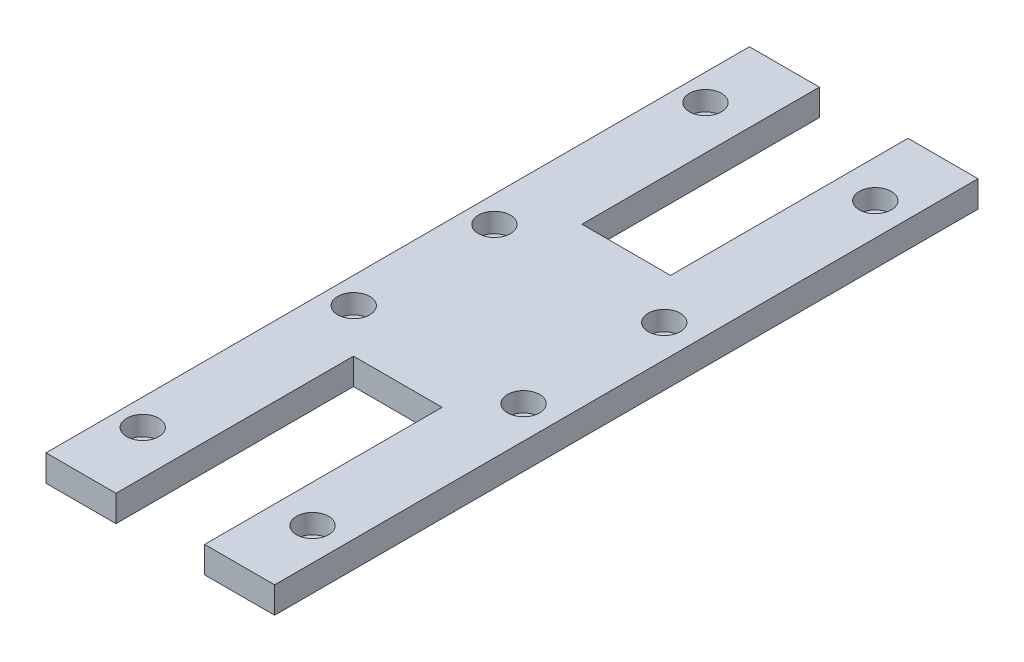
from build123d import *

# Parameters (mm, degrees)
SKETCH1_W           = 41.275
SKETCH1_H           = 4.7625
BOSS_EXTRUDE1_DEPTH = 127
SKETCH2_W           = 16.002
SKETCH2_H           = 42.8752
CUT_EXTRUDE1_DEPTH  = 127
SKETCH3_R           = 1.778
CUT_EXTRUDE2_DEPTH  = 6.35
SKETCH4_R           = 2.8956
CUT_EXTRUDE3_DEPTH  = 3.5052


with BuildPart() as part:
    # Sketch1 → Boss-Extrude1 (new body)
    with BuildSketch(Plane.XY):
        with Locations((20.6375, 2.38125)):
            Rectangle(SKETCH1_W, SKETCH1_H)
    extrude(amount=-BOSS_EXTRUDE1_DEPTH)

    # Sketch2 → Cut-Extrude1 (cut)
    with BuildSketch(Plane(origin=(0, 4.7625, 0), x_dir=(1, 0, 0), z_dir=(0, 1, 0))):
        with Locations((20.6375, 105.5624)):
            Rectangle(SKETCH2_W, SKETCH2_H)
        with Locations((20.6375, 21.4376)):
            Rectangle(SKETCH2_W, SKETCH2_H)
    extrude(amount=-CUT_EXTRUDE1_DEPTH, mode=Mode.SUBTRACT)

    # Sketch3 → Cut-Extrude2 (cut)
    with BuildSketch(Plane(origin=(0, 4.7625, 0), x_dir=(1, 0, 0), z_dir=(0, 1, 0))):
        with Locations(Location((4.7625, 114.3, 0), (0, 0, 270))):
            Circle(SKETCH3_R)
        with Locations(Location((4.7625, 76.2, 0), (0, 0, 270))):
            Circle(SKETCH3_R)
        with Locations(Location((4.7625, 50.8, 0), (0, 0, 270))):
            Circle(SKETCH3_R)
        with Locations(Location((4.7625, 12.7, 0), (0, 0, 270))):
            Circle(SKETCH3_R)
        with Locations(Location((35.428502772, 114.3, 0), (0, 0, 270))):
            Circle(SKETCH3_R)
        with Locations(Location((35.428502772, 76.2, 0), (0, 0, 270))):
            Circle(SKETCH3_R)
        with Locations(Location((35.428502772, 50.8, 0), (0, 0, 270))):
            Circle(SKETCH3_R)
        with Locations(Location((35.428502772, 12.7, 0), (0, 0, 270))):
            Circle(SKETCH3_R)
    extrude(amount=-CUT_EXTRUDE2_DEPTH, mode=Mode.SUBTRACT)

    # Sketch4 → Cut-Extrude3 (cut)
    with BuildSketch(Plane(origin=(0, 4.7625, 0), x_dir=(1, 0, 0), z_dir=(0, 1, 0))):
        with Locations(Location((4.7625, 114.3, 0), (0, 0, 270))):
            Circle(SKETCH4_R)
        with Locations(Location((4.7625, 76.2, 0), (0, 0, 270))):
            Circle(SKETCH4_R)
        with Locations(Location((4.7625, 50.8, 0), (0, 0, 270))):
            Circle(SKETCH4_R)
        with Locations(Location((4.7625, 12.7, 0), (0, 0, 270))):
            Circle(SKETCH4_R)
        with Locations(Location((35.428502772, 12.7, 0), (0, 0, 270))):
            Circle(SKETCH4_R)
        with Locations(Location((35.428502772, 50.8, 0), (0, 0, 270))):
            Circle(SKETCH4_R)
        with Locations(Location((35.428502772, 76.2, 0), (0, 0, 270))):
            Circle(SKETCH4_R)
        with Locations(Location((35.428502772, 114.3, 0), (0, 0, 270))):
            Circle(SKETCH4_R)
    extrude(amount=-CUT_EXTRUDE3_DEPTH, mode=Mode.SUBTRACT)


solid = part.part
